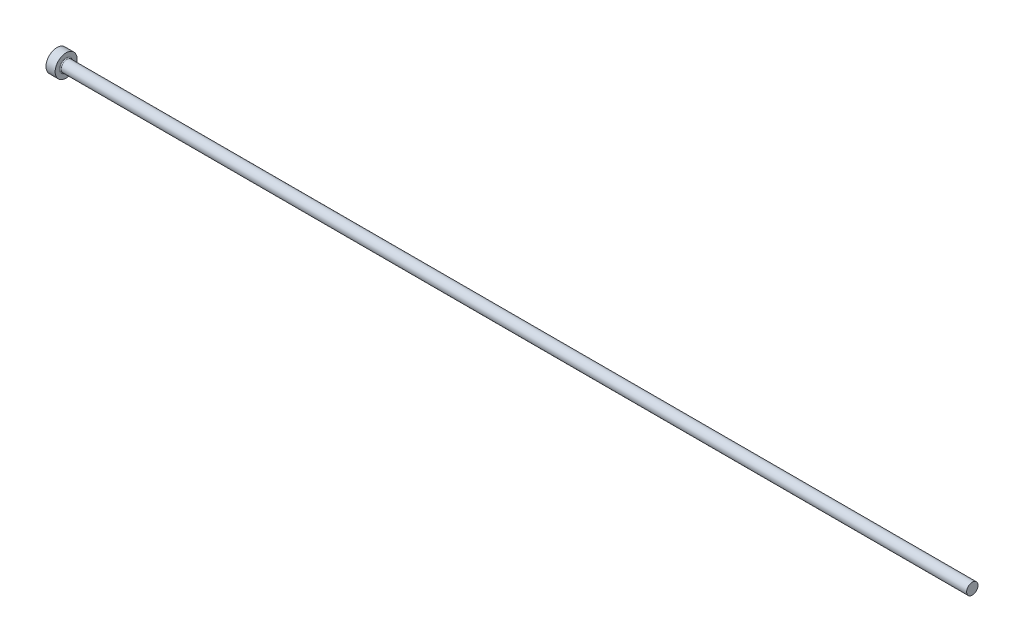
ISO-10303-21;
HEADER;
FILE_DESCRIPTION(('STEP AP214'),'2;1');
FILE_NAME('part.step','',(''),(''),'','','');
FILE_SCHEMA(('AUTOMOTIVE_DESIGN { 1 0 10303 214 1 1 1 1 }'));
ENDSEC;
DATA;
#1=APPLICATION_CONTEXT('core data for automotive mechanical design processes');
#2=APPLICATION_PROTOCOL_DEFINITION('international standard','automotive_design',2000,#1);
#3=PRODUCT_CONTEXT('',#1,'mechanical');
#4=PRODUCT('Part','Part','',(#3));
#5=PRODUCT_RELATED_PRODUCT_CATEGORY('part','',(#4));
#6=PRODUCT_DEFINITION_FORMATION('','',#4);
#7=PRODUCT_DEFINITION_CONTEXT('part definition',#1,'design');
#8=PRODUCT_DEFINITION('design','',#6,#7);
#9=PRODUCT_DEFINITION_SHAPE('','',#8);
#10=(LENGTH_UNIT() NAMED_UNIT(*) SI_UNIT(.MILLI.,.METRE.));
#11=(NAMED_UNIT(*) PLANE_ANGLE_UNIT() SI_UNIT($,.RADIAN.));
#12=(NAMED_UNIT(*) SI_UNIT($,.STERADIAN.) SOLID_ANGLE_UNIT());
#13=UNCERTAINTY_MEASURE_WITH_UNIT(LENGTH_MEASURE(1.E-05),#10,'distance_accuracy_value','');
#14=(GEOMETRIC_REPRESENTATION_CONTEXT(3) GLOBAL_UNCERTAINTY_ASSIGNED_CONTEXT((#13)) GLOBAL_UNIT_ASSIGNED_CONTEXT((#10,
#11,#12)) REPRESENTATION_CONTEXT('',''));
#15=CARTESIAN_POINT('',(0.,0.,0.));
#16=DIRECTION('',(0.,0.,1.));
#17=DIRECTION('',(1.,0.,0.));
#18=AXIS2_PLACEMENT_3D('',#15,#16,#17);
#19=CARTESIAN_POINT('',(0.,0.,0.));
#20=DIRECTION('',(-1.,0.,0.));
#21=DIRECTION('',(0.,-1.,0.));
#22=AXIS2_PLACEMENT_3D('',#19,#20,#21);
#23=PLANE('',#22);
#24=CARTESIAN_POINT('',(0.,0.,0.));
#25=DIRECTION('',(1.,0.,0.));
#26=DIRECTION('',(0.,1.,0.));
#27=AXIS2_PLACEMENT_3D('',#24,#25,#26);
#28=CIRCLE('',#27,6.);
#29=CARTESIAN_POINT('',(0.,6.,0.));
#30=VERTEX_POINT('',#29);
#31=EDGE_CURVE('E25',#30,#30,#28,.T.);
#32=ORIENTED_EDGE('',*,*,#31,.F.);
#33=EDGE_LOOP('',(#32));
#34=FACE_BOUND('',#33,.T.);
#35=ADVANCED_FACE('F14',(#34),#23,.T.);
#36=CARTESIAN_POINT('',(500.,0.,0.));
#37=DIRECTION('',(1.,0.,0.));
#38=DIRECTION('',(0.,1.,0.));
#39=AXIS2_PLACEMENT_3D('',#36,#37,#38);
#40=CYLINDRICAL_SURFACE('',#39,6.);
#41=ORIENTED_EDGE('',*,*,#31,.T.);
#42=EDGE_LOOP('',(#41));
#43=FACE_BOUND('',#42,.T.);
#44=CARTESIAN_POINT('',(5.,0.,0.));
#45=DIRECTION('',(1.,0.,0.));
#46=DIRECTION('',(0.,1.,0.));
#47=AXIS2_PLACEMENT_3D('',#44,#45,#46);
#48=CIRCLE('',#47,6.);
#49=CARTESIAN_POINT('',(5.,6.,0.));
#50=VERTEX_POINT('',#49);
#51=EDGE_CURVE('E29',#50,#50,#48,.T.);
#52=ORIENTED_EDGE('',*,*,#51,.F.);
#53=EDGE_LOOP('',(#52));
#54=FACE_BOUND('',#53,.T.);
#55=ADVANCED_FACE('F51',(#43,#54),#40,.T.);
#56=CARTESIAN_POINT('',(5.,6.,0.));
#57=DIRECTION('',(1.,0.,0.));
#58=DIRECTION('',(0.,1.,0.));
#59=AXIS2_PLACEMENT_3D('',#56,#57,#58);
#60=PLANE('',#59);
#61=CARTESIAN_POINT('',(5.,0.,0.));
#62=DIRECTION('',(1.,0.,0.));
#63=DIRECTION('',(0.,1.,0.));
#64=AXIS2_PLACEMENT_3D('',#61,#62,#63);
#65=CIRCLE('',#64,3.59999999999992);
#66=CARTESIAN_POINT('',(5.,3.59999999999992,0.));
#67=VERTEX_POINT('',#66);
#68=EDGE_CURVE('E9',#67,#67,#65,.F.);
#69=ORIENTED_EDGE('',*,*,#68,.T.);
#70=EDGE_LOOP('',(#69));
#71=FACE_BOUND('',#70,.T.);
#72=ORIENTED_EDGE('',*,*,#51,.T.);
#73=EDGE_LOOP('',(#72));
#74=FACE_BOUND('',#73,.T.);
#75=ADVANCED_FACE('F42',(#71,#74),#60,.T.);
#76=CARTESIAN_POINT('',(500.,0.,0.));
#77=DIRECTION('',(1.,0.,0.));
#78=DIRECTION('',(0.,1.,0.));
#79=AXIS2_PLACEMENT_3D('',#76,#77,#78);
#80=CYLINDRICAL_SURFACE('',#79,3.09999999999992);
#81=CARTESIAN_POINT('',(5.5,0.,0.));
#82=DIRECTION('',(1.,0.,0.));
#83=DIRECTION('',(0.,1.,0.));
#84=AXIS2_PLACEMENT_3D('',#81,#82,#83);
#85=CIRCLE('',#84,3.09999999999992);
#86=CARTESIAN_POINT('',(5.5,3.09999999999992,0.));
#87=VERTEX_POINT('',#86);
#88=EDGE_CURVE('E21',#87,#87,#85,.T.);
#89=ORIENTED_EDGE('',*,*,#88,.T.);
#90=EDGE_LOOP('',(#89));
#91=FACE_BOUND('',#90,.T.);
#92=CARTESIAN_POINT('',(500.,0.,0.));
#93=DIRECTION('',(1.,0.,0.));
#94=DIRECTION('',(0.,1.,0.));
#95=AXIS2_PLACEMENT_3D('',#92,#93,#94);
#96=CIRCLE('',#95,3.09999999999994);
#97=CARTESIAN_POINT('',(500.,3.09999999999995,0.));
#98=VERTEX_POINT('',#97);
#99=EDGE_CURVE('E34',#98,#98,#96,.T.);
#100=ORIENTED_EDGE('',*,*,#99,.F.);
#101=EDGE_LOOP('',(#100));
#102=FACE_BOUND('',#101,.T.);
#103=ADVANCED_FACE('F40',(#91,#102),#80,.T.);
#104=CARTESIAN_POINT('',(500.,3.09999999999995,0.));
#105=DIRECTION('',(1.,0.,0.));
#106=DIRECTION('',(0.,1.,0.));
#107=AXIS2_PLACEMENT_3D('',#104,#105,#106);
#108=PLANE('',#107);
#109=ORIENTED_EDGE('',*,*,#99,.T.);
#110=EDGE_LOOP('',(#109));
#111=FACE_BOUND('',#110,.T.);
#112=ADVANCED_FACE('F38',(#111),#108,.T.);
#113=CARTESIAN_POINT('',(5.5,0.,0.));
#114=DIRECTION('',(1.,0.,0.));
#115=DIRECTION('',(0.,1.,0.));
#116=AXIS2_PLACEMENT_3D('',#113,#114,#115);
#117=TOROIDAL_SURFACE('',#116,3.59999999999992,0.5);
#118=ORIENTED_EDGE('',*,*,#68,.F.);
#119=EDGE_LOOP('',(#118));
#120=FACE_BOUND('',#119,.T.);
#121=ORIENTED_EDGE('',*,*,#88,.F.);
#122=EDGE_LOOP('',(#121));
#123=FACE_BOUND('',#122,.T.);
#124=ADVANCED_FACE('F16',(#120,#123),#117,.F.);
#125=CLOSED_SHELL('',(#35,#55,#75,#103,#112,#124));
#126=MANIFOLD_SOLID_BREP('B1',#125);
#127=ADVANCED_BREP_SHAPE_REPRESENTATION('',(#18,#126),#14);
#128=SHAPE_DEFINITION_REPRESENTATION(#9,#127);
ENDSEC;
END-ISO-10303-21;
